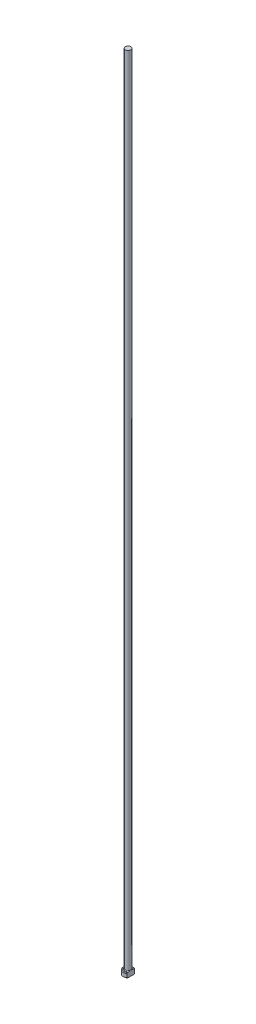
from build123d import *
from build123d.topology import SkipClean

# Parameters (mm, degrees)
CHAMFER1_SIZE = 0.2
FILLET1_R     = 0.2
KEY_DEPTH     = 251.008999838


with BuildPart() as part:
    # Sketch1 → Revolve1 (revolve)
    with BuildSketch(Plane.XY, mode=Mode.PRIVATE) as revolve1_sk:
        Polygon((0, 0), (-1.5, 0), (-1.5, 1.5), (-0.85, 1.5), (-0.85, 250), (0, 250), align=None)
    revolve(revolve1_sk.sketch.rotate(Axis((0, 259.958771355, 0), (0, -1, 0)), 270), axis=Axis((0, 259.958771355, 0), (0, -1, 0)))

    # Chamfer1
    chamfer1_edges = [part.edges().sort_by_distance(p)[0] for p in [
        (0, 1.5, -1.5),
        (0, 0, -1.5),
    ]]
    chamfer(chamfer1_edges, length=CHAMFER1_SIZE)

    # Fillet1
    fillet1_edges = [part.edges().sort_by_distance(p)[0] for p in [
        (0, 1.5, -0.85),
    ]]
    fillet(fillet1_edges, radius=FILLET1_R)

    # Sketch2 → KEY (cut, through all)
    with SkipClean():  # the faces are left unmerged after this step: merging them gives an invalid solid
        with BuildSketch(Plane(origin=(0, 0, 0), x_dir=(1, 0, 0), z_dir=(0, 1, 0))):
            with BuildLine():
                Line((0.85, 1.235920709), (0.85, -1.235920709))
                ThreePointArc((0.85, -1.235920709), (1.5, 0), (0.85, 1.235920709))
            make_face()
        extrude(amount=KEY_DEPTH, mode=Mode.SUBTRACT)


solid = part.part
